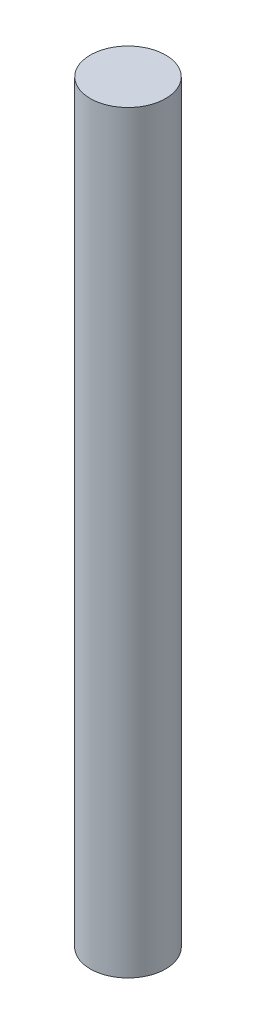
ISO-10303-21;
HEADER;
FILE_DESCRIPTION(('STEP AP214'),'2;1');
FILE_NAME('part.step','',(''),(''),'','','');
FILE_SCHEMA(('AUTOMOTIVE_DESIGN { 1 0 10303 214 1 1 1 1 }'));
ENDSEC;
DATA;
#1=APPLICATION_CONTEXT('core data for automotive mechanical design processes');
#2=APPLICATION_PROTOCOL_DEFINITION('international standard','automotive_design',2000,#1);
#3=PRODUCT_CONTEXT('',#1,'mechanical');
#4=PRODUCT('Part','Part','',(#3));
#5=PRODUCT_RELATED_PRODUCT_CATEGORY('part','',(#4));
#6=PRODUCT_DEFINITION_FORMATION('','',#4);
#7=PRODUCT_DEFINITION_CONTEXT('part definition',#1,'design');
#8=PRODUCT_DEFINITION('design','',#6,#7);
#9=PRODUCT_DEFINITION_SHAPE('','',#8);
#10=(LENGTH_UNIT() NAMED_UNIT(*) SI_UNIT(.MILLI.,.METRE.));
#11=(NAMED_UNIT(*) PLANE_ANGLE_UNIT() SI_UNIT($,.RADIAN.));
#12=(NAMED_UNIT(*) SI_UNIT($,.STERADIAN.) SOLID_ANGLE_UNIT());
#13=UNCERTAINTY_MEASURE_WITH_UNIT(LENGTH_MEASURE(1.E-05),#10,'distance_accuracy_value','');
#14=(GEOMETRIC_REPRESENTATION_CONTEXT(3) GLOBAL_UNCERTAINTY_ASSIGNED_CONTEXT((#13)) GLOBAL_UNIT_ASSIGNED_CONTEXT((#10,
#11,#12)) REPRESENTATION_CONTEXT('',''));
#15=CARTESIAN_POINT('',(0.,0.,0.));
#16=DIRECTION('',(0.,0.,1.));
#17=DIRECTION('',(1.,0.,0.));
#18=AXIS2_PLACEMENT_3D('',#15,#16,#17);
#19=CARTESIAN_POINT('',(0.,50.8,0.));
#20=DIRECTION('',(0.,-1.,0.));
#21=DIRECTION('',(0.,0.,-1.));
#22=AXIS2_PLACEMENT_3D('',#19,#20,#21);
#23=CYLINDRICAL_SURFACE('',#22,2.54);
#24=CARTESIAN_POINT('',(0.,50.8,0.));
#25=DIRECTION('',(0.,1.,0.));
#26=DIRECTION('',(0.,0.,1.));
#27=AXIS2_PLACEMENT_3D('',#24,#25,#26);
#28=CIRCLE('',#27,2.54);
#29=CARTESIAN_POINT('',(0.,50.8,2.54));
#30=VERTEX_POINT('',#29);
#31=EDGE_CURVE('E10',#30,#30,#28,.T.);
#32=ORIENTED_EDGE('',*,*,#31,.F.);
#33=EDGE_LOOP('',(#32));
#34=FACE_BOUND('',#33,.T.);
#35=CARTESIAN_POINT('',(0.,0.,0.));
#36=DIRECTION('',(0.,1.,0.));
#37=DIRECTION('',(0.,0.,1.));
#38=AXIS2_PLACEMENT_3D('',#35,#36,#37);
#39=CIRCLE('',#38,2.54);
#40=CARTESIAN_POINT('',(0.,0.,2.54));
#41=VERTEX_POINT('',#40);
#42=EDGE_CURVE('E34',#41,#41,#39,.T.);
#43=ORIENTED_EDGE('',*,*,#42,.T.);
#44=EDGE_LOOP('',(#43));
#45=FACE_BOUND('',#44,.T.);
#46=ADVANCED_FACE('F31',(#34,#45),#23,.T.);
#47=CARTESIAN_POINT('',(0.,50.8,0.));
#48=DIRECTION('',(0.,1.,0.));
#49=DIRECTION('',(0.,0.,1.));
#50=AXIS2_PLACEMENT_3D('',#47,#48,#49);
#51=PLANE('',#50);
#52=ORIENTED_EDGE('',*,*,#31,.T.);
#53=EDGE_LOOP('',(#52));
#54=FACE_BOUND('',#53,.T.);
#55=ADVANCED_FACE('F46',(#54),#51,.T.);
#56=CARTESIAN_POINT('',(0.,0.,0.));
#57=DIRECTION('',(0.,1.,0.));
#58=DIRECTION('',(0.,0.,1.));
#59=AXIS2_PLACEMENT_3D('',#56,#57,#58);
#60=PLANE('',#59);
#61=ORIENTED_EDGE('',*,*,#42,.F.);
#62=EDGE_LOOP('',(#61));
#63=FACE_BOUND('',#62,.T.);
#64=ADVANCED_FACE('F44',(#63),#60,.F.);
#65=CLOSED_SHELL('',(#46,#55,#64));
#66=MANIFOLD_SOLID_BREP('B2',#65);
#67=ADVANCED_BREP_SHAPE_REPRESENTATION('',(#18,#66),#14);
#68=SHAPE_DEFINITION_REPRESENTATION(#9,#67);
ENDSEC;
END-ISO-10303-21;
